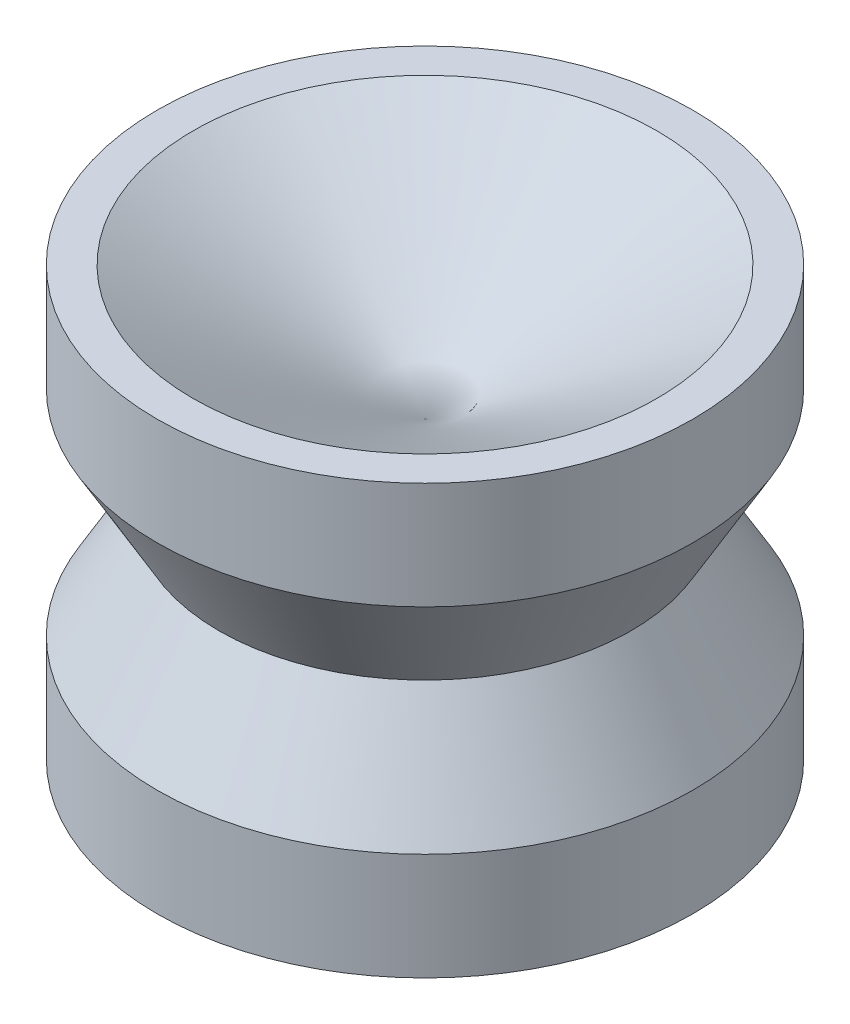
from build123d import *

# Parameters (mm, degrees)
SKETCH2_W = 2.5
SKETCH2_H = 4


with BuildPart() as part:
    # Sketch2 → Revolve1 (revolve)
    with BuildSketch(Plane.XY, mode=Mode.PRIVATE) as revolve1_sk:
        with Locations((-1.25, 0)):
            Rectangle(SKETCH2_W, SKETCH2_H)
    revolve(revolve1_sk.sketch.rotate(Axis((0, 50, 0), (0, -1, 0)), 270), axis=Axis((0, 50, 0), (0, -1, 0)))

    # Sketch17 → Cut-Revolve4 (revolve, cut)
    with BuildSketch(Plane.XY, mode=Mode.PRIVATE) as cut_revolve4_sk:
        Polygon((-1.922649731, 0), (-2.5, -1), (-2.5, 1), align=None)
    revolve(cut_revolve4_sk.sketch.rotate(Axis((0, 50, 0), (0, -1, 0)), 270), axis=Axis((0, 50, 0), (0, -1, 0)), mode=Mode.SUBTRACT)

    # Sketch5 → Cut-Revolve1 (revolve, cut)
    with BuildSketch(Plane.XY, mode=Mode.PRIVATE) as cut_revolve1_sk:
        Polygon((0, 0.75), (0, 2), (-2.165063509, 2), align=None)
    revolve(cut_revolve1_sk.sketch.rotate(Axis((0, 50, 0), (0, -1, 0)), 270), axis=Axis((0, 50, 0), (0, -1, 0)), mode=Mode.SUBTRACT)


solid = part.part
